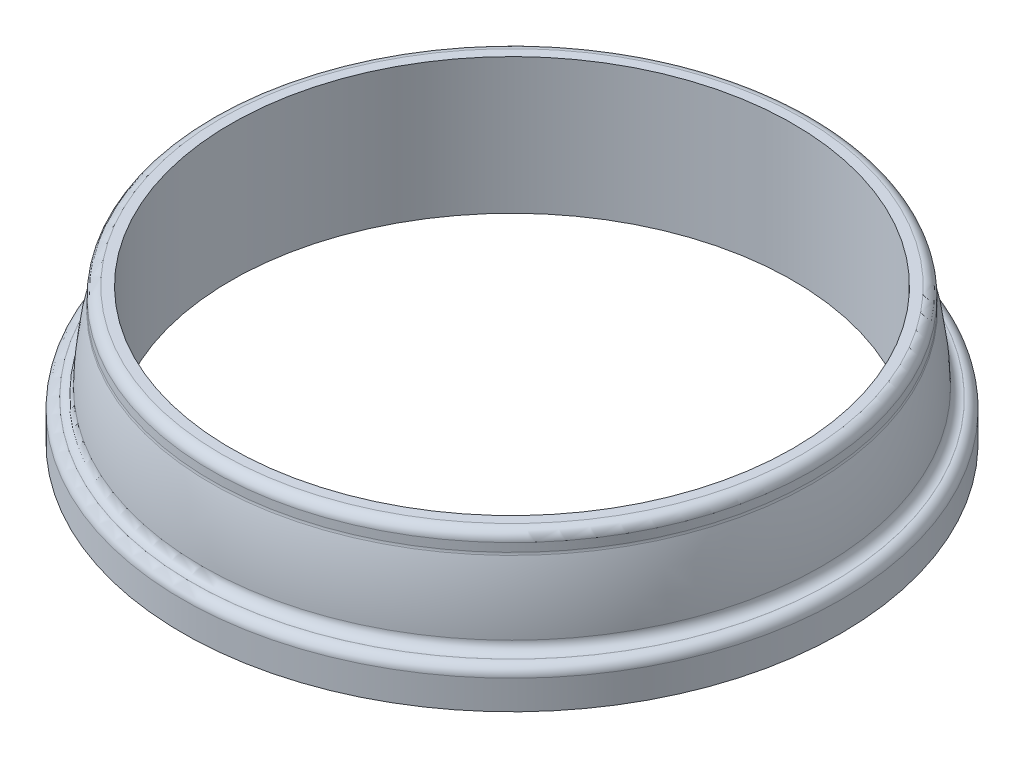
ISO-10303-21;
HEADER;
FILE_DESCRIPTION(('STEP AP214'),'2;1');
FILE_NAME('part.step','',(''),(''),'','','');
FILE_SCHEMA(('AUTOMOTIVE_DESIGN { 1 0 10303 214 1 1 1 1 }'));
ENDSEC;
DATA;
#1=APPLICATION_CONTEXT('core data for automotive mechanical design processes');
#2=APPLICATION_PROTOCOL_DEFINITION('international standard','automotive_design',2000,#1);
#3=PRODUCT_CONTEXT('',#1,'mechanical');
#4=PRODUCT('Part','Part','',(#3));
#5=PRODUCT_RELATED_PRODUCT_CATEGORY('part','',(#4));
#6=PRODUCT_DEFINITION_FORMATION('','',#4);
#7=PRODUCT_DEFINITION_CONTEXT('part definition',#1,'design');
#8=PRODUCT_DEFINITION('design','',#6,#7);
#9=PRODUCT_DEFINITION_SHAPE('','',#8);
#10=(LENGTH_UNIT() NAMED_UNIT(*) SI_UNIT(.MILLI.,.METRE.));
#11=(NAMED_UNIT(*) PLANE_ANGLE_UNIT() SI_UNIT($,.RADIAN.));
#12=(NAMED_UNIT(*) SI_UNIT($,.STERADIAN.) SOLID_ANGLE_UNIT());
#13=UNCERTAINTY_MEASURE_WITH_UNIT(LENGTH_MEASURE(1.E-05),#10,'distance_accuracy_value','');
#14=(GEOMETRIC_REPRESENTATION_CONTEXT(3) GLOBAL_UNCERTAINTY_ASSIGNED_CONTEXT((#13)) GLOBAL_UNIT_ASSIGNED_CONTEXT((#10,
#11,#12)) REPRESENTATION_CONTEXT('',''));
#15=CARTESIAN_POINT('',(0.,0.,0.));
#16=DIRECTION('',(0.,0.,1.));
#17=DIRECTION('',(1.,0.,0.));
#18=AXIS2_PLACEMENT_3D('',#15,#16,#17);
#19=CARTESIAN_POINT('',(14.5,0.,0.));
#20=DIRECTION('',(0.,-1.,0.));
#21=DIRECTION('',(1.,0.,0.));
#22=AXIS2_PLACEMENT_3D('',#19,#20,#21);
#23=PLANE('',#22);
#24=CARTESIAN_POINT('',(0.,0.,0.));
#25=DIRECTION('',(0.,-1.,0.));
#26=DIRECTION('',(1.,0.,0.));
#27=AXIS2_PLACEMENT_3D('',#24,#25,#26);
#28=CIRCLE('',#27,17.);
#29=CARTESIAN_POINT('',(17.,0.,0.));
#30=VERTEX_POINT('',#29);
#31=EDGE_CURVE('E70',#30,#30,#28,.T.);
#32=ORIENTED_EDGE('',*,*,#31,.T.);
#33=EDGE_LOOP('',(#32));
#34=FACE_BOUND('',#33,.T.);
#35=CARTESIAN_POINT('',(0.,0.,0.));
#36=DIRECTION('',(0.,-1.,0.));
#37=DIRECTION('',(1.,0.,0.));
#38=AXIS2_PLACEMENT_3D('',#35,#36,#37);
#39=CIRCLE('',#38,14.5);
#40=CARTESIAN_POINT('',(14.5,0.,0.));
#41=VERTEX_POINT('',#40);
#42=EDGE_CURVE('E64',#41,#41,#39,.T.);
#43=ORIENTED_EDGE('',*,*,#42,.F.);
#44=EDGE_LOOP('',(#43));
#45=FACE_BOUND('',#44,.T.);
#46=ADVANCED_FACE('F32',(#34,#45),#23,.T.);
#47=CARTESIAN_POINT('',(0.,0.,0.));
#48=DIRECTION('',(0.,-1.,0.));
#49=DIRECTION('',(1.,0.,0.));
#50=AXIS2_PLACEMENT_3D('',#47,#48,#49);
#51=CYLINDRICAL_SURFACE('',#50,14.5);
#52=ORIENTED_EDGE('',*,*,#42,.T.);
#53=EDGE_LOOP('',(#52));
#54=FACE_BOUND('',#53,.T.);
#55=CARTESIAN_POINT('',(0.,7.,0.));
#56=DIRECTION('',(0.,-1.,0.));
#57=DIRECTION('',(1.,0.,0.));
#58=AXIS2_PLACEMENT_3D('',#55,#56,#57);
#59=CIRCLE('',#58,14.5);
#60=CARTESIAN_POINT('',(14.5,7.,0.));
#61=VERTEX_POINT('',#60);
#62=EDGE_CURVE('E67',#61,#61,#59,.T.);
#63=ORIENTED_EDGE('',*,*,#62,.F.);
#64=EDGE_LOOP('',(#63));
#65=FACE_BOUND('',#64,.T.);
#66=ADVANCED_FACE('F92',(#54,#65),#51,.F.);
#67=CARTESIAN_POINT('',(15.5,7.,0.));
#68=DIRECTION('',(0.,1.,0.));
#69=DIRECTION('',(-1.,0.,0.));
#70=AXIS2_PLACEMENT_3D('',#67,#68,#69);
#71=PLANE('',#70);
#72=CARTESIAN_POINT('',(0.,7.,0.));
#73=DIRECTION('',(0.,1.,0.));
#74=DIRECTION('',(-1.,0.,0.));
#75=AXIS2_PLACEMENT_3D('',#72,#73,#74);
#76=CIRCLE('',#75,15.);
#77=CARTESIAN_POINT('',(-15.,7.,0.));
#78=VERTEX_POINT('',#77);
#79=EDGE_CURVE('E55',#78,#78,#76,.T.);
#80=ORIENTED_EDGE('',*,*,#79,.T.);
#81=EDGE_LOOP('',(#80));
#82=FACE_BOUND('',#81,.T.);
#83=ORIENTED_EDGE('',*,*,#62,.T.);
#84=EDGE_LOOP('',(#83));
#85=FACE_BOUND('',#84,.T.);
#86=ADVANCED_FACE('F97',(#82,#85),#71,.T.);
#87=CARTESIAN_POINT('',(0.,0.,0.));
#88=DIRECTION('',(0.,-1.,0.));
#89=DIRECTION('',(1.,0.,0.));
#90=AXIS2_PLACEMENT_3D('',#87,#88,#89);
#91=CYLINDRICAL_SURFACE('',#90,15.5);
#92=CARTESIAN_POINT('',(0.,6.5,0.));
#93=DIRECTION('',(0.,1.,0.));
#94=DIRECTION('',(-1.,0.,0.));
#95=AXIS2_PLACEMENT_3D('',#92,#93,#94);
#96=CIRCLE('',#95,15.5);
#97=CARTESIAN_POINT('',(-15.5,6.5,0.));
#98=VERTEX_POINT('',#97);
#99=EDGE_CURVE('E58',#98,#98,#96,.F.);
#100=ORIENTED_EDGE('',*,*,#99,.T.);
#101=EDGE_LOOP('',(#100));
#102=FACE_BOUND('',#101,.T.);
#103=CARTESIAN_POINT('',(0.,6.06460542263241,0.));
#104=DIRECTION('',(0.,-1.,0.));
#105=DIRECTION('',(1.,0.,0.));
#106=AXIS2_PLACEMENT_3D('',#103,#104,#105);
#107=CIRCLE('',#106,15.5);
#108=CARTESIAN_POINT('',(15.5,6.06460542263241,0.));
#109=VERTEX_POINT('',#108);
#110=EDGE_CURVE('E61',#109,#109,#107,.F.);
#111=ORIENTED_EDGE('',*,*,#110,.T.);
#112=EDGE_LOOP('',(#111));
#113=FACE_BOUND('',#112,.T.);
#114=ADVANCED_FACE('F119',(#102,#113),#91,.T.);
#115=CARTESIAN_POINT('',(0.,2.15635186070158,0.));
#116=DIRECTION('',(0.,-1.,0.));
#117=DIRECTION('',(1.,0.,0.));
#118=AXIS2_PLACEMENT_3D('',#115,#116,#117);
#119=DEGENERATE_TOROIDAL_SURFACE('',#118,1.00081488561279,15.,.T.);
#120=CARTESIAN_POINT('',(0.,5.93853272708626,0.));
#121=DIRECTION('',(0.,-1.,0.));
#122=DIRECTION('',(1.,0.,0.));
#123=AXIS2_PLACEMENT_3D('',#120,#121,#122);
#124=CIRCLE('',#123,15.5161553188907);
#125=CARTESIAN_POINT('',(15.5161553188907,5.93853272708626,0.));
#126=VERTEX_POINT('',#125);
#127=EDGE_CURVE('E47',#126,#126,#124,.T.);
#128=ORIENTED_EDGE('',*,*,#127,.T.);
#129=EDGE_LOOP('',(#128));
#130=FACE_BOUND('',#129,.T.);
#131=CARTESIAN_POINT('',(0.,2.48891457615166,0.));
#132=DIRECTION('',(0.,-1.,0.));
#133=DIRECTION('',(1.,0.,0.));
#134=AXIS2_PLACEMENT_3D('',#131,#132,#133);
#135=CIRCLE('',#134,15.9971278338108);
#136=CARTESIAN_POINT('',(15.9971278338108,2.48891457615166,0.));
#137=VERTEX_POINT('',#136);
#138=EDGE_CURVE('E52',#137,#137,#135,.F.);
#139=ORIENTED_EDGE('',*,*,#138,.T.);
#140=EDGE_LOOP('',(#139));
#141=FACE_BOUND('',#140,.T.);
#142=ADVANCED_FACE('F89',(#130,#141),#119,.T.);
#143=CARTESIAN_POINT('',(17.,2.,0.));
#144=DIRECTION('',(0.,1.,0.));
#145=DIRECTION('',(-1.,0.,0.));
#146=AXIS2_PLACEMENT_3D('',#143,#144,#145);
#147=PLANE('',#146);
#148=CARTESIAN_POINT('',(0.,2.,0.));
#149=DIRECTION('',(0.,1.,0.));
#150=DIRECTION('',(-1.,0.,0.));
#151=AXIS2_PLACEMENT_3D('',#148,#149,#150);
#152=CIRCLE('',#151,16.5);
#153=CARTESIAN_POINT('',(-16.5,2.,0.));
#154=VERTEX_POINT('',#153);
#155=EDGE_CURVE('E10',#154,#154,#152,.T.);
#156=ORIENTED_EDGE('',*,*,#155,.T.);
#157=EDGE_LOOP('',(#156));
#158=FACE_BOUND('',#157,.T.);
#159=CARTESIAN_POINT('',(0.,2.,0.));
#160=DIRECTION('',(0.,1.,0.));
#161=DIRECTION('',(-1.,0.,0.));
#162=AXIS2_PLACEMENT_3D('',#159,#160,#161);
#163=CIRCLE('',#162,16.4970049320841);
#164=CARTESIAN_POINT('',(-16.4970049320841,2.,0.));
#165=VERTEX_POINT('',#164);
#166=EDGE_CURVE('E39',#165,#165,#163,.F.);
#167=ORIENTED_EDGE('',*,*,#166,.T.);
#168=EDGE_LOOP('',(#167));
#169=FACE_BOUND('',#168,.T.);
#170=ADVANCED_FACE('F79',(#158,#169),#147,.T.);
#171=CARTESIAN_POINT('',(0.,0.,0.));
#172=DIRECTION('',(0.,-1.,0.));
#173=DIRECTION('',(1.,0.,0.));
#174=AXIS2_PLACEMENT_3D('',#171,#172,#173);
#175=CYLINDRICAL_SURFACE('',#174,17.);
#176=CARTESIAN_POINT('',(0.,1.5,0.));
#177=DIRECTION('',(0.,1.,0.));
#178=DIRECTION('',(-1.,0.,0.));
#179=AXIS2_PLACEMENT_3D('',#176,#177,#178);
#180=CIRCLE('',#179,17.);
#181=CARTESIAN_POINT('',(-17.,1.5,0.));
#182=VERTEX_POINT('',#181);
#183=EDGE_CURVE('E43',#182,#182,#180,.F.);
#184=ORIENTED_EDGE('',*,*,#183,.T.);
#185=EDGE_LOOP('',(#184));
#186=FACE_BOUND('',#185,.T.);
#187=ORIENTED_EDGE('',*,*,#31,.F.);
#188=EDGE_LOOP('',(#187));
#189=FACE_BOUND('',#188,.T.);
#190=ADVANCED_FACE('F76',(#186,#189),#175,.T.);
#191=CARTESIAN_POINT('',(0.,6.5,0.));
#192=DIRECTION('',(0.,1.,0.));
#193=DIRECTION('',(-1.,0.,0.));
#194=AXIS2_PLACEMENT_3D('',#191,#192,#193);
#195=TOROIDAL_SURFACE('',#194,15.,0.5);
#196=ORIENTED_EDGE('',*,*,#79,.F.);
#197=EDGE_LOOP('',(#196));
#198=FACE_BOUND('',#197,.T.);
#199=ORIENTED_EDGE('',*,*,#99,.F.);
#200=EDGE_LOOP('',(#199));
#201=FACE_BOUND('',#200,.T.);
#202=ADVANCED_FACE('F78',(#198,#201),#195,.T.);
#203=CARTESIAN_POINT('',(0.,6.06460542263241,0.));
#204=DIRECTION('',(0.,-1.,0.));
#205=DIRECTION('',(1.,0.,0.));
#206=AXIS2_PLACEMENT_3D('',#203,#204,#205);
#207=TOROIDAL_SURFACE('',#206,16.,0.5);
#208=ORIENTED_EDGE('',*,*,#110,.F.);
#209=EDGE_LOOP('',(#208));
#210=FACE_BOUND('',#209,.T.);
#211=ORIENTED_EDGE('',*,*,#127,.F.);
#212=EDGE_LOOP('',(#211));
#213=FACE_BOUND('',#212,.T.);
#214=ADVANCED_FACE('F86',(#210,#213),#207,.F.);
#215=CARTESIAN_POINT('',(0.,1.5,0.));
#216=DIRECTION('',(0.,1.,0.));
#217=DIRECTION('',(-1.,0.,0.));
#218=AXIS2_PLACEMENT_3D('',#215,#216,#217);
#219=TOROIDAL_SURFACE('',#218,16.5,0.5);
#220=ORIENTED_EDGE('',*,*,#155,.F.);
#221=EDGE_LOOP('',(#220));
#222=FACE_BOUND('',#221,.T.);
#223=ORIENTED_EDGE('',*,*,#183,.F.);
#224=EDGE_LOOP('',(#223));
#225=FACE_BOUND('',#224,.T.);
#226=ADVANCED_FACE('F103',(#222,#225),#219,.T.);
#227=CARTESIAN_POINT('',(0.,2.5,0.));
#228=DIRECTION('',(0.,1.,0.));
#229=DIRECTION('',(-1.,0.,0.));
#230=AXIS2_PLACEMENT_3D('',#227,#228,#229);
#231=TOROIDAL_SURFACE('',#230,16.4970049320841,0.5);
#232=ORIENTED_EDGE('',*,*,#138,.F.);
#233=EDGE_LOOP('',(#232));
#234=FACE_BOUND('',#233,.T.);
#235=ORIENTED_EDGE('',*,*,#166,.F.);
#236=EDGE_LOOP('',(#235));
#237=FACE_BOUND('',#236,.T.);
#238=ADVANCED_FACE('F34',(#234,#237),#231,.F.);
#239=CLOSED_SHELL('',(#46,#66,#86,#114,#142,#170,#190,#202,#214,#226,#238));
#240=MANIFOLD_SOLID_BREP('B2',#239);
#241=ADVANCED_BREP_SHAPE_REPRESENTATION('',(#18,#240),#14);
#242=SHAPE_DEFINITION_REPRESENTATION(#9,#241);
ENDSEC;
END-ISO-10303-21;
